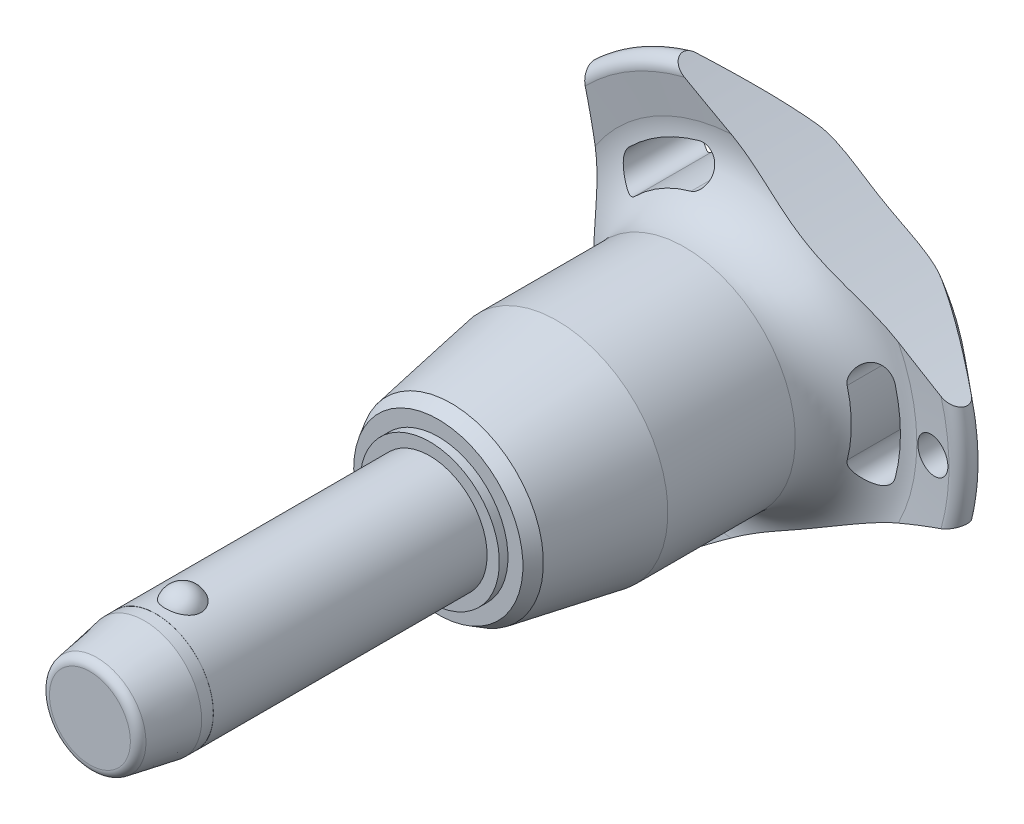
from build123d import *

# Parameters (mm, degrees)
SKETCH1_R           = 5
BOSS_EXTRUDE1_DEPTH = 20
SKETCH2_R           = 4.25
BOSS_EXTRUDE2_DEPTH = 33.3
BOSS_EXTRUDE3_START = 9.6
SKETCH1_2_R         = 5
BOSS_EXTRUDE3_DEPTH = 9.6
CHAMFER1_SIZE       = 4.8
CHAMFER1_SIZE2      = 0.846369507
FILLET1_R           = 0.75
SKETCH6_R           = 102.8
CUT_EXTRUDE1_DEPTH  = 61.079897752
CIRPATTERN1_COUNT   = 3
SKETCH7_R           = 1.5
CUT_EXTRUDE2_DEPTH  = 60.810087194
SKETCH8_R           = 5
SKETCH8_R_2         = 4.99
CUT_EXTRUDE3_DEPTH  = 5.76


with BuildPart() as part:
    # Sketch1 → Boss-Extrude1 (new body)
    with BuildSketch(Plane.XY):
        Circle(SKETCH1_R)
    extrude(amount=-BOSS_EXTRUDE1_DEPTH)

    # Sketch2 → Boss-Extrude2 (add)
    with BuildSketch(Plane(origin=(0, 0, -20), x_dir=(-1, 0, 0), z_dir=(0, 0, -1))):
        Circle(SKETCH2_R)
    extrude(amount=BOSS_EXTRUDE2_DEPTH)

    # Sketch3 → Revolve1 (revolve)
    with BuildSketch(Plane(origin=(0, 0, 0), x_dir=(0, 0, -1), z_dir=(1, 0, 0))):
        with BuildLine():
            Line((-1.516575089, 6), (-1.516575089, 2.7))
            ThreePointArc((-1.516575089, 2.7), (0.133424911, 4.35), (-1.516575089, 6))
        make_face()
        with BuildLine():
            Line((-1.516575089, -2.7), (-1.516575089, -6))
            ThreePointArc((-1.516575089, -6), (0.133424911, -4.35), (-1.516575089, -2.7))
        make_face()
    revolve(axis=Axis((0, -2.7, 1.516575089), (0, 1, 0)))

    # Sketch1_2 → Boss-Extrude3 (add)
    with BuildSketch(Plane.XY.offset(BOSS_EXTRUDE3_START)):
        Circle(SKETCH1_2_R)
    extrude(amount=-BOSS_EXTRUDE3_DEPTH)

    # Chamfer1
    chamfer1_edges = [part.edges().sort_by_distance(p)[0] for p in [
        (-5, 0, 9.6),
    ]]
    chamfer1_side = [part.faces().sort_by_distance(p)[0] for p in [
        (-5, 0, -5.2),
    ]]
    chamfer(chamfer1_edges, length=CHAMFER1_SIZE, length2=CHAMFER1_SIZE2, reference=chamfer1_side[0])

    # Fillet1
    fillet1_edges = [part.edges().sort_by_distance(p)[0] for p in [
        (-4.153630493, 0, 9.6),
        (4.25, 0, -53.3),
    ]]
    fillet(fillet1_edges, radius=FILLET1_R)

    # Sketch4 → Revolve2 (revolve)
    with BuildSketch(Plane(origin=(0, 0, 0), x_dir=(0, 0, -1), z_dir=(1, 0, 0)), mode=Mode.PRIVATE) as revolve2_sk:
        Polygon((20, 0), (20, 6.067402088), (20.75, 6.067402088), (20.75, 7.371950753), (21.879772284, 8.024225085), (31.1, 9.65), (42.2, 9.65), (42.2, 0), align=None)
    revolve(revolve2_sk.sketch.rotate(Axis((0, 0, -42.2), (0, 0, 1)), 90), axis=Axis((0, 0, -42.2), (0, 0, 1)))

    # Sketch5 → Revolve3 (revolve)
    with BuildSketch(Plane(origin=(0, 0, 0), x_dir=(0, 0, -1), z_dir=(1, 0, 0)), mode=Mode.PRIVATE) as revolve3_sk:
        with BuildLine():
            Line((47.16082631, 15.274661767), (46.757834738, 18.475067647))
            ThreePointArc((46.757834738, 18.475067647), (47.349836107, 19.516443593), (48.516044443, 19.24278761))
            Line((48.516044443, 19.24278761), (52.835691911, 14.094832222))
            ThreePointArc((52.835691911, 14.094832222), (53.3, 12.689260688), (52.67067517, 11.349423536))
            ThreePointArc((52.67067517, 11.349423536), (49.033110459, 6.185112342), (47.75, 0))
            Line((47.75, 0), (42.2, 0))
            Line((42.2, 0), (42.2, 9.65))
            ThreePointArc((42.2, 9.65), (45.949887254, 11.342683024), (47.16082631, 15.274661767))
        make_face()
    revolve(revolve3_sk.sketch.rotate(Axis((0, 0, -47.75), (0, 0, 1)), 90), axis=Axis((0, 0, -47.75), (0, 0, 1)))

    # Sketch6 → Cut-Extrude1 (cut, through all)
    with BuildSketch(Plane.XY):
        with Locations((-115.2, 0)):
            Circle(SKETCH6_R)
        with BuildLine():
            ThreePointArc((13.411913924, -3.529271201), (13.868496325, 0), (13.411913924, 3.529271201))
            ThreePointArc((13.411913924, 3.529271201), (11.694200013, 4.531299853), (10.692171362, 2.813585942))
            ThreePointArc((10.692171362, 2.813585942), (11.056165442, 0), (10.692171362, -2.813585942))
            ThreePointArc((10.692171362, -2.813585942), (11.694200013, -4.531299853), (13.411913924, -3.529271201))
        make_face()
    cut_extrude1 = extrude(amount=-CUT_EXTRUDE1_DEPTH, mode=Mode.SUBTRACT)

    # CirPattern1: Cut-Extrude1 ×3 about axis
    cirpattern1_axis = Axis((0, 0, 0), (0, 0, 1))
    for i in range(1, CIRPATTERN1_COUNT):
        add(cut_extrude1.rotate(cirpattern1_axis, i * 360 / CIRPATTERN1_COUNT), mode=Mode.SUBTRACT)

    # Sketch7 → Cut-Extrude2 (cut, through all)
    with BuildSketch(Plane.XY):
        with Locations(Location((16.868496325, 0, 0), (0, 0, 225.467095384))):
            Circle(SKETCH7_R)
    extrude(amount=-CUT_EXTRUDE2_DEPTH, mode=Mode.SUBTRACT)

    # Sketch8 → Cut-Extrude3 (cut)
    with BuildSketch(Plane.XY.offset(9.6)):
        Circle(SKETCH8_R)
        Circle(SKETCH8_R_2, mode=Mode.SUBTRACT)
    extrude(amount=-CUT_EXTRUDE3_DEPTH, mode=Mode.SUBTRACT)


solid = part.part
